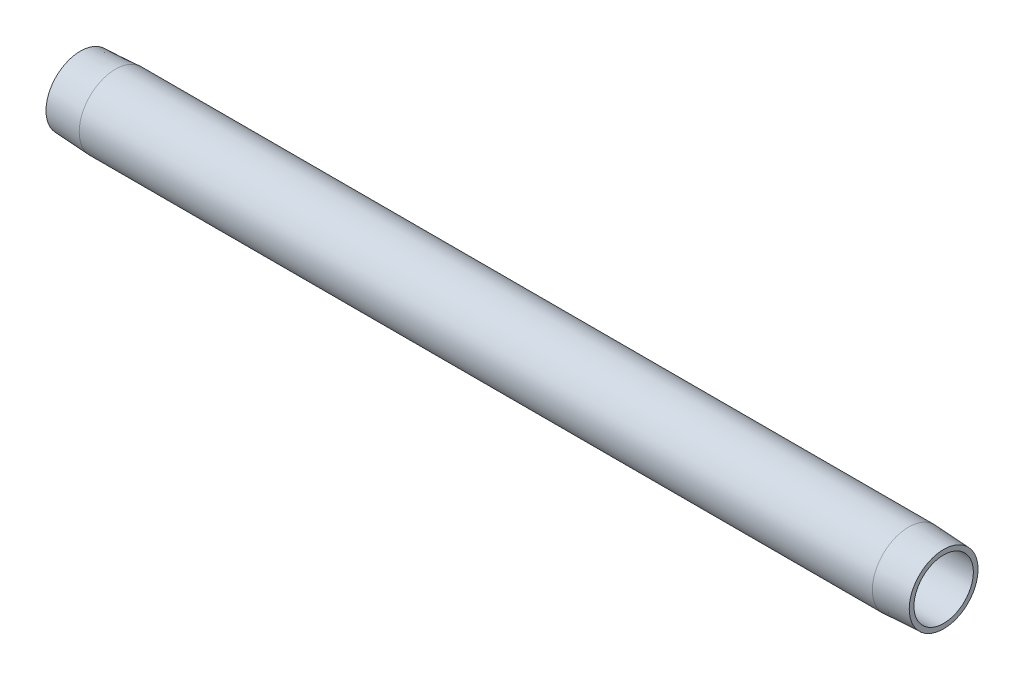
from build123d import *


with BuildPart() as part:
    # Sketch1 → Revolve1 (revolve)
    with BuildSketch(Plane.XY, mode=Mode.PRIVATE) as revolve1_sk:
        Polygon((254, 8.73125), (0, 8.73125), (0, 10.127550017), (10.3124, 10.668), (243.6876, 10.668), (254, 10.127550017), align=None)
    revolve(revolve1_sk.sketch.rotate(Axis((0, 0, 0), (1, 0, 0)), 90), axis=Axis((0, 0, 0), (1, 0, 0)))


solid = part.part
